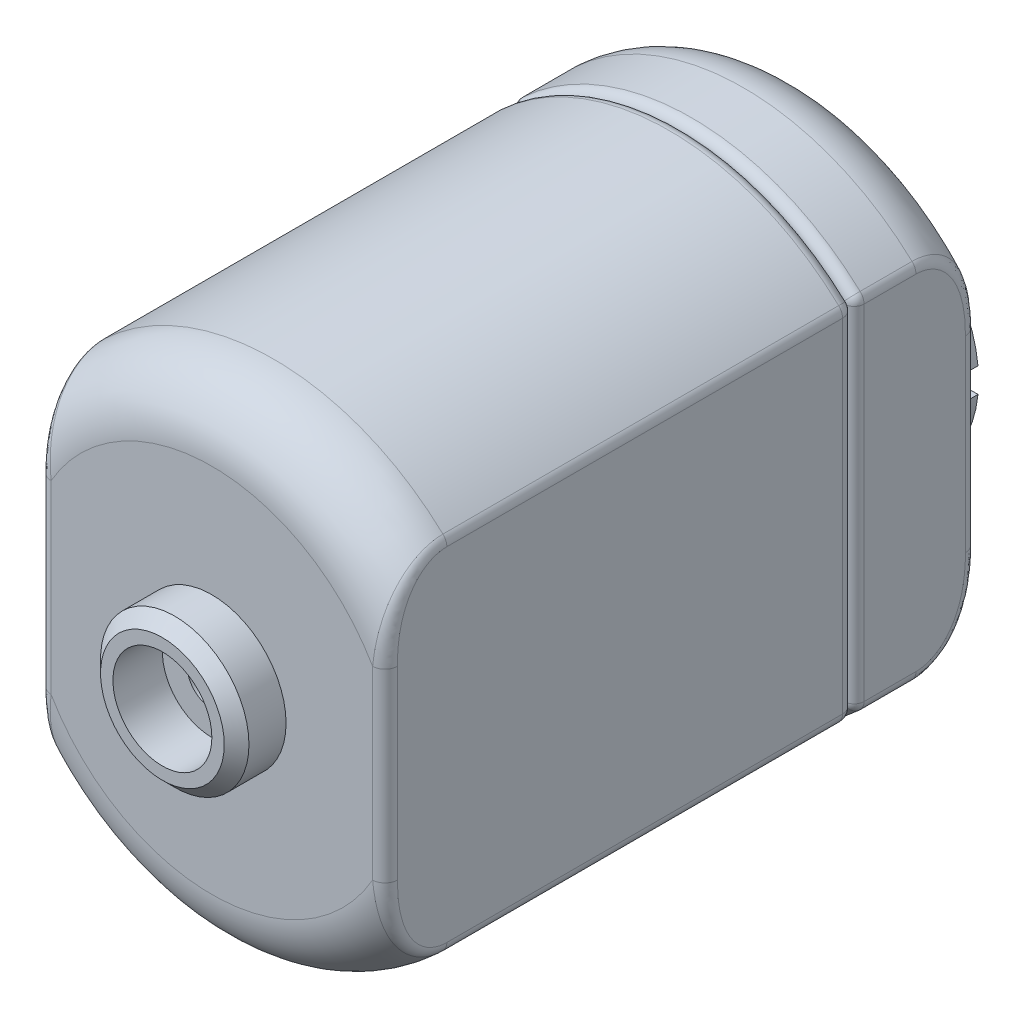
from build123d import *

# Parameters (mm, degrees)
BASE_EXTRUSION_DEPTH    = 19
ESQUISSE3_R             = 3
BOSS_EXTRU_2_DEPTH      = 2
CHANFREIN1_SIZE         = 0.5
CONG_1_R                = 2.5
CONG_2_R                = 0.5
CONG_3_R                = 0.5
BOSS_EXTRU_6_START      = 5
BOSS_EXTRU_6_DEPTH      = 5
CONG_4_R                = 2.5
CONG_5_R                = 0.5
CONG_7_R                = 0.4
ESQUISSE9_W             = 0.2
ESQUISSE9_H             = 6.3
BOSS_EXTRU_7_DEPTH      = 2
ESQUISSE10_R            = 1
BOSS_EXTRU_8_DEPTH      = 1
ESQUISSE11_R            = 1
ENL_V_MAT_EXTRU_3_DEPTH = 32.464265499
ESQUISSE12_R            = 2
ENL_V_MAT_EXTRU_4_DEPTH = 2


with BuildPart() as part:
    # Esquisse1 → Base-Extrusion (new body)
    with BuildSketch(Plane.XY):
        with BuildLine():
            Line((-7, 7.141428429), (-7, -7.141428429))
            ThreePointArc((-7, -7.141428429), (0, -10), (7, -7.141428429))
            Line((7, -7.141428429), (7, 7.141428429))
            ThreePointArc((7, 7.141428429), (0, 10), (-7, 7.141428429))
        make_face()
    extrude(amount=BASE_EXTRUSION_DEPTH)

    # Esquisse3 → Boss.-Extru.2 (add)
    with BuildSketch(Plane.XY.offset(19)):
        Circle(ESQUISSE3_R)
    extrude(amount=BOSS_EXTRU_2_DEPTH)

    # Chanfrein1
    chanfrein1_edges = [part.edges().sort_by_distance(p)[0] for p in [
        (-3, 0, 21),
    ]]
    chamfer(chanfrein1_edges, length=CHANFREIN1_SIZE)

    # Cong_1
    cong_1_edges = [part.edges().sort_by_distance(p)[0] for p in [
        (0, 10, 19),
        (0, -10, 19),
    ]]
    fillet(cong_1_edges, radius=CONG_1_R)

    # Cong_2
    cong_2_edges = [part.edges().sort_by_distance(p)[0] for p in [
        (7, 0, 19),
        (-7, 0, 19),
        (7, 7.141428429, 8.25),
        (7, -7.141428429, 8.25),
        (7, 5.474347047, 18.580345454),
        (7, -5.474347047, 18.580345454),
        (-7, -7.141428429, 8.25),
        (-7, 7.141428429, 8.25),
        (-7, 5.474347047, 18.580345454),
        (-7, -5.474347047, 18.580345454),
    ]]
    fillet(cong_2_edges, radius=CONG_2_R)

    # Cong_3
    cong_3_edges = [part.edges().sort_by_distance(p)[0] for p in [
        (-7, 0, 0),
        (0, -10, 0),
        (0, 10, 0),
        (7, 0, 0),
        (6.958831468, -7.126883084, 0),
        (6.958831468, 7.126883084, 0),
        (-6.958831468, -7.126883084, 0),
        (-6.958831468, 7.126883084, 0),
    ]]
    fillet(cong_3_edges, radius=CONG_3_R)

    # Esquisse8 → Boss.-Extru.6 (add)
    with BuildSketch(Plane(origin=(0, 0, 0), x_dir=(-1, 0, 0), z_dir=(0, 0, -1)).offset(BOSS_EXTRU_6_START)):
        with BuildLine():
            Line((-6.967856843, 7.172793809), (-6.967856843, -7.172793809))
            ThreePointArc((-6.967856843, -7.172793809), (0, -10), (6.967856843, -7.172793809))
            Line((6.967856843, -7.172793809), (6.967856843, 7.172793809))
            ThreePointArc((6.967856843, 7.172793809), (0, 10), (-6.967856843, 7.172793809))
        make_face()
    extrude(amount=-BOSS_EXTRU_6_DEPTH)

    # Cong_4
    cong_4_edges = [part.edges().sort_by_distance(p)[0] for p in [
        (0, 10, -5),
        (0, -10, -5),
    ]]
    fillet(cong_4_edges, radius=CONG_4_R)

    # Cong_5
    cong_5_edges = [part.edges().sort_by_distance(p)[0] for p in [
        (6.967856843, 0, -5),
        (-6.967856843, 0, -5),
        (6.967856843, -7.172793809, -1.25),
        (6.967856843, 7.172793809, -1.25),
        (6.967856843, -5.530801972, -4.573854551),
        (6.967856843, 5.530801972, -4.573854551),
        (-6.967856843, 7.172793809, -1.25),
        (-6.967856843, -7.172793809, -1.25),
        (-6.967856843, -5.530801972, -4.573854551),
        (-6.967856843, 5.530801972, -4.573854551),
    ]]
    fillet(cong_5_edges, radius=CONG_5_R)

    # Cong_7
    cong_7_edges = [part.edges().sort_by_distance(p)[0] for p in [
        (6.967856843, 0, 0),
        (0, 10, 0),
        (-6.967856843, 0, 0),
        (0, -10, 0),
        (-6.926227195, -7.157961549, 0),
        (-6.926227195, 7.157961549, 0),
        (6.926227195, -7.157961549, 0),
        (6.926227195, 7.157961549, 0),
    ]]
    fillet(cong_7_edges, radius=CONG_7_R)

    # Esquisse9 → Boss.-Extru.7 (add)
    with BuildSketch(Plane(origin=(0, 0, -5), x_dir=(-1, 0, 0), z_dir=(0, 0, -1))):
        with BuildLine():
            Line((3.5, 3.570714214), (3.5, -3.570714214))
            ThreePointArc((3.5, -3.570714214), (-1.703285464, -4.700938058), (-4.974937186, -0.5))
            Line((-4.974937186, -0.5), (-4.4, -0.5))
            ThreePointArc((-4.4, -0.5), (-4.117157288, -0.382842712), (-4, -0.1))
            Line((-4, -0.1), (-4, 0))
            ThreePointArc((-4, 0), (-4.146446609, 0.353553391), (-4.5, 0.5))
            Line((-4.5, 0.5), (-4.974937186, 0.5))
            ThreePointArc((-4.974937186, 0.5), (-1.703285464, 4.700938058), (3.5, 3.570714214))
        make_face()
        with Locations((-2.8, 0.05)):
            Rectangle(ESQUISSE9_W, ESQUISSE9_H, mode=Mode.SUBTRACT)
    extrude(amount=BOSS_EXTRU_7_DEPTH)

    # Esquisse10 → Boss.-Extru.8 (add)
    with BuildSketch(Plane(origin=(0, 0, -7), x_dir=(-1, 0, 0), z_dir=(0, 0, -1))):
        Circle(ESQUISSE10_R)
    extrude(amount=BOSS_EXTRU_8_DEPTH)

    # Esquisse11 → Enl_v. mat.-Extru.3 (cut, through all)
    with BuildSketch(Plane.XY.offset(21)):
        Circle(ESQUISSE11_R)
    extrude(amount=-ENL_V_MAT_EXTRU_3_DEPTH, mode=Mode.SUBTRACT)

    # Esquisse12 → Enl_v. mat.-Extru.4 (cut)
    with BuildSketch(Plane.XY.offset(21)):
        Circle(ESQUISSE12_R)
    extrude(amount=-ENL_V_MAT_EXTRU_4_DEPTH, mode=Mode.SUBTRACT)


solid = part.part
